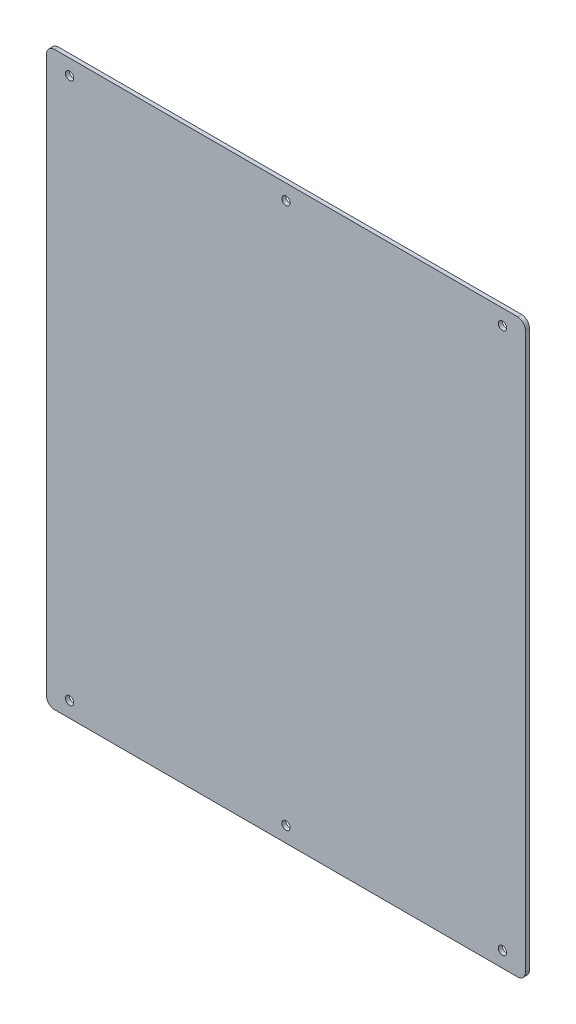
ISO-10303-21;
HEADER;
FILE_DESCRIPTION(('STEP AP214'),'2;1');
FILE_NAME('part.step','',(''),(''),'','','');
FILE_SCHEMA(('AUTOMOTIVE_DESIGN { 1 0 10303 214 1 1 1 1 }'));
ENDSEC;
DATA;
#1=APPLICATION_CONTEXT('core data for automotive mechanical design processes');
#2=APPLICATION_PROTOCOL_DEFINITION('international standard','automotive_design',2000,#1);
#3=PRODUCT_CONTEXT('',#1,'mechanical');
#4=PRODUCT('Part','Part','',(#3));
#5=PRODUCT_RELATED_PRODUCT_CATEGORY('part','',(#4));
#6=PRODUCT_DEFINITION_FORMATION('','',#4);
#7=PRODUCT_DEFINITION_CONTEXT('part definition',#1,'design');
#8=PRODUCT_DEFINITION('design','',#6,#7);
#9=PRODUCT_DEFINITION_SHAPE('','',#8);
#10=(LENGTH_UNIT() NAMED_UNIT(*) SI_UNIT(.MILLI.,.METRE.));
#11=(NAMED_UNIT(*) PLANE_ANGLE_UNIT() SI_UNIT($,.RADIAN.));
#12=(NAMED_UNIT(*) SI_UNIT($,.STERADIAN.) SOLID_ANGLE_UNIT());
#13=UNCERTAINTY_MEASURE_WITH_UNIT(LENGTH_MEASURE(1.E-05),#10,'distance_accuracy_value','');
#14=(GEOMETRIC_REPRESENTATION_CONTEXT(3) GLOBAL_UNCERTAINTY_ASSIGNED_CONTEXT((#13)) GLOBAL_UNIT_ASSIGNED_CONTEXT((#10,
#11,#12)) REPRESENTATION_CONTEXT('',''));
#15=CARTESIAN_POINT('',(0.,0.,0.));
#16=DIRECTION('',(0.,0.,1.));
#17=DIRECTION('',(1.,0.,0.));
#18=AXIS2_PLACEMENT_3D('',#15,#16,#17);
#19=CARTESIAN_POINT('',(0.,0.,0.));
#20=DIRECTION('',(0.,0.,-1.));
#21=DIRECTION('',(-1.,0.,0.));
#22=AXIS2_PLACEMENT_3D('',#19,#20,#21);
#23=PLANE('',#22);
#24=DIRECTION('',(0.,-1.,0.));
#25=VECTOR('',#24,1.);
#26=CARTESIAN_POINT('',(0.,0.,0.));
#27=LINE('',#26,#25);
#28=CARTESIAN_POINT('',(-1.09476674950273E-13,449.76999984,0.));
#29=VERTEX_POINT('',#28);
#30=CARTESIAN_POINT('',(0.,6.35,0.));
#31=VERTEX_POINT('',#30);
#32=EDGE_CURVE('E113',#29,#31,#27,.T.);
#33=ORIENTED_EDGE('',*,*,#32,.T.);
#34=CARTESIAN_POINT('',(6.35,6.35,0.));
#35=DIRECTION('',(0.,0.,-1.));
#36=DIRECTION('',(-1.,0.,0.));
#37=AXIS2_PLACEMENT_3D('',#34,#35,#36);
#38=CIRCLE('',#37,6.35);
#39=CARTESIAN_POINT('',(6.35,0.,0.));
#40=VERTEX_POINT('',#39);
#41=EDGE_CURVE('E147',#31,#40,#38,.F.);
#42=ORIENTED_EDGE('',*,*,#41,.T.);
#43=DIRECTION('',(1.,0.,0.));
#44=VECTOR('',#43,1.);
#45=CARTESIAN_POINT('',(0.,0.,0.));
#46=LINE('',#45,#44);
#47=CARTESIAN_POINT('',(375.65,0.,0.));
#48=VERTEX_POINT('',#47);
#49=EDGE_CURVE('E130',#40,#48,#46,.T.);
#50=ORIENTED_EDGE('',*,*,#49,.T.);
#51=CARTESIAN_POINT('',(375.65,6.35,0.));
#52=DIRECTION('',(0.,0.,-1.));
#53=DIRECTION('',(-1.,0.,0.));
#54=AXIS2_PLACEMENT_3D('',#51,#52,#53);
#55=CIRCLE('',#54,6.35);
#56=CARTESIAN_POINT('',(382.,6.35,0.));
#57=VERTEX_POINT('',#56);
#58=EDGE_CURVE('E145',#48,#57,#55,.F.);
#59=ORIENTED_EDGE('',*,*,#58,.T.);
#60=DIRECTION('',(0.,1.,0.));
#61=VECTOR('',#60,1.);
#62=CARTESIAN_POINT('',(382.,0.,0.));
#63=LINE('',#62,#61);
#64=CARTESIAN_POINT('',(382.,449.76999984,0.));
#65=VERTEX_POINT('',#64);
#66=EDGE_CURVE('E173',#57,#65,#63,.T.);
#67=ORIENTED_EDGE('',*,*,#66,.T.);
#68=CARTESIAN_POINT('',(375.65,449.76999984,0.));
#69=DIRECTION('',(0.,0.,-1.));
#70=DIRECTION('',(-1.,0.,0.));
#71=AXIS2_PLACEMENT_3D('',#68,#69,#70);
#72=CIRCLE('',#71,6.35);
#73=CARTESIAN_POINT('',(375.65,456.11999984,0.));
#74=VERTEX_POINT('',#73);
#75=EDGE_CURVE('E120',#65,#74,#72,.F.);
#76=ORIENTED_EDGE('',*,*,#75,.T.);
#77=DIRECTION('',(-1.,0.,0.));
#78=VECTOR('',#77,1.);
#79=CARTESIAN_POINT('',(-1.11022302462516E-13,456.11999984,0.));
#80=LINE('',#79,#78);
#81=CARTESIAN_POINT('',(6.34999999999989,456.11999984,0.));
#82=VERTEX_POINT('',#81);
#83=EDGE_CURVE('E115',#74,#82,#80,.T.);
#84=ORIENTED_EDGE('',*,*,#83,.T.);
#85=CARTESIAN_POINT('',(6.34999999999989,449.76999984,0.));
#86=DIRECTION('',(0.,0.,-1.));
#87=DIRECTION('',(-1.,0.,0.));
#88=AXIS2_PLACEMENT_3D('',#85,#86,#87);
#89=CIRCLE('',#88,6.35);
#90=EDGE_CURVE('E110',#82,#29,#89,.F.);
#91=ORIENTED_EDGE('',*,*,#90,.T.);
#92=EDGE_LOOP('',(#33,#42,#50,#59,#67,#76,#84,#91));
#93=FACE_BOUND('',#92,.T.);
#94=CARTESIAN_POINT('',(18.3499999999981,12.2999996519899,0.));
#95=DIRECTION('',(0.,0.,1.));
#96=DIRECTION('',(1.,0.,0.));
#97=AXIS2_PLACEMENT_3D('',#94,#95,#96);
#98=CIRCLE('',#97,3.3);
#99=CARTESIAN_POINT('',(21.6499999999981,12.2999996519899,0.));
#100=VERTEX_POINT('',#99);
#101=EDGE_CURVE('E185',#100,#100,#98,.T.);
#102=ORIENTED_EDGE('',*,*,#101,.F.);
#103=EDGE_LOOP('',(#102));
#104=FACE_BOUND('',#103,.T.);
#105=CARTESIAN_POINT('',(190.999999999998,12.2999996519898,0.));
#106=DIRECTION('',(0.,0.,1.));
#107=DIRECTION('',(1.,0.,0.));
#108=AXIS2_PLACEMENT_3D('',#105,#106,#107);
#109=CIRCLE('',#108,3.3);
#110=CARTESIAN_POINT('',(194.299999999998,12.2999996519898,0.));
#111=VERTEX_POINT('',#110);
#112=EDGE_CURVE('E191',#111,#111,#109,.T.);
#113=ORIENTED_EDGE('',*,*,#112,.F.);
#114=EDGE_LOOP('',(#113));
#115=FACE_BOUND('',#114,.T.);
#116=CARTESIAN_POINT('',(363.649999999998,12.2999996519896,0.));
#117=DIRECTION('',(0.,0.,1.));
#118=DIRECTION('',(1.,0.,0.));
#119=AXIS2_PLACEMENT_3D('',#116,#117,#118);
#120=CIRCLE('',#119,3.30000000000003);
#121=CARTESIAN_POINT('',(366.949999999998,12.2999996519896,0.));
#122=VERTEX_POINT('',#121);
#123=EDGE_CURVE('E197',#122,#122,#120,.T.);
#124=ORIENTED_EDGE('',*,*,#123,.F.);
#125=EDGE_LOOP('',(#124));
#126=FACE_BOUND('',#125,.T.);
#127=CARTESIAN_POINT('',(363.649999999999,443.819999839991,0.));
#128=DIRECTION('',(0.,0.,1.));
#129=DIRECTION('',(1.,0.,0.));
#130=AXIS2_PLACEMENT_3D('',#127,#128,#129);
#131=CIRCLE('',#130,3.30000000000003);
#132=CARTESIAN_POINT('',(366.949999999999,443.819999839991,0.));
#133=VERTEX_POINT('',#132);
#134=EDGE_CURVE('E203',#133,#133,#131,.T.);
#135=ORIENTED_EDGE('',*,*,#134,.F.);
#136=EDGE_LOOP('',(#135));
#137=FACE_BOUND('',#136,.T.);
#138=CARTESIAN_POINT('',(190.999999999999,443.819999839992,0.));
#139=DIRECTION('',(0.,0.,1.));
#140=DIRECTION('',(1.,0.,0.));
#141=AXIS2_PLACEMENT_3D('',#138,#139,#140);
#142=CIRCLE('',#141,3.3);
#143=CARTESIAN_POINT('',(194.299999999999,443.819999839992,0.));
#144=VERTEX_POINT('',#143);
#145=EDGE_CURVE('E209',#144,#144,#142,.T.);
#146=ORIENTED_EDGE('',*,*,#145,.F.);
#147=EDGE_LOOP('',(#146));
#148=FACE_BOUND('',#147,.T.);
#149=CARTESIAN_POINT('',(18.3499999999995,443.819999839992,0.));
#150=DIRECTION('',(0.,0.,1.));
#151=DIRECTION('',(1.,0.,0.));
#152=AXIS2_PLACEMENT_3D('',#149,#150,#151);
#153=CIRCLE('',#152,3.3);
#154=CARTESIAN_POINT('',(21.6499999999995,443.819999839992,0.));
#155=VERTEX_POINT('',#154);
#156=EDGE_CURVE('E215',#155,#155,#153,.T.);
#157=ORIENTED_EDGE('',*,*,#156,.F.);
#158=EDGE_LOOP('',(#157));
#159=FACE_BOUND('',#158,.T.);
#160=ADVANCED_FACE('F44',(#93,#104,#115,#126,#137,#148,#159),#23,.F.);
#161=CARTESIAN_POINT('',(0.,0.,-3.175));
#162=DIRECTION('',(-1.,0.,0.));
#163=DIRECTION('',(0.,-1.,0.));
#164=AXIS2_PLACEMENT_3D('',#161,#162,#163);
#165=PLANE('',#164);
#166=DIRECTION('',(0.,-1.,0.));
#167=VECTOR('',#166,1.);
#168=CARTESIAN_POINT('',(0.,0.,-3.175));
#169=LINE('',#168,#167);
#170=CARTESIAN_POINT('',(-1.09476674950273E-13,449.76999984,-3.175));
#171=VERTEX_POINT('',#170);
#172=CARTESIAN_POINT('',(0.,6.35,-3.175));
#173=VERTEX_POINT('',#172);
#174=EDGE_CURVE('E175',#171,#173,#169,.T.);
#175=ORIENTED_EDGE('',*,*,#174,.T.);
#176=DIRECTION('',(0.,0.,1.));
#177=VECTOR('',#176,1.);
#178=CARTESIAN_POINT('',(0.,6.35,-3.175));
#179=LINE('',#178,#177);
#180=EDGE_CURVE('E121',#173,#31,#179,.T.);
#181=ORIENTED_EDGE('',*,*,#180,.T.);
#182=ORIENTED_EDGE('',*,*,#32,.F.);
#183=DIRECTION('',(0.,0.,1.));
#184=VECTOR('',#183,1.);
#185=CARTESIAN_POINT('',(-1.09476674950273E-13,449.76999984,-3.175));
#186=LINE('',#185,#184);
#187=EDGE_CURVE('E127',#29,#171,#186,.F.);
#188=ORIENTED_EDGE('',*,*,#187,.T.);
#189=EDGE_LOOP('',(#175,#181,#182,#188));
#190=FACE_BOUND('',#189,.T.);
#191=ADVANCED_FACE('F126',(#190),#165,.T.);
#192=CARTESIAN_POINT('',(-1.11022302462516E-13,456.11999984,-3.175));
#193=DIRECTION('',(0.,1.,0.));
#194=DIRECTION('',(0.,0.,1.));
#195=AXIS2_PLACEMENT_3D('',#192,#193,#194);
#196=PLANE('',#195);
#197=ORIENTED_EDGE('',*,*,#83,.F.);
#198=DIRECTION('',(0.,0.,1.));
#199=VECTOR('',#198,1.);
#200=CARTESIAN_POINT('',(375.65,456.11999984,-3.175));
#201=LINE('',#200,#199);
#202=CARTESIAN_POINT('',(375.65,456.11999984,-3.175));
#203=VERTEX_POINT('',#202);
#204=EDGE_CURVE('E11',#74,#203,#201,.F.);
#205=ORIENTED_EDGE('',*,*,#204,.T.);
#206=DIRECTION('',(-1.,0.,0.));
#207=VECTOR('',#206,1.);
#208=CARTESIAN_POINT('',(-1.11022302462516E-13,456.11999984,-3.175));
#209=LINE('',#208,#207);
#210=CARTESIAN_POINT('',(6.34999999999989,456.11999984,-3.175));
#211=VERTEX_POINT('',#210);
#212=EDGE_CURVE('E135',#203,#211,#209,.T.);
#213=ORIENTED_EDGE('',*,*,#212,.T.);
#214=DIRECTION('',(0.,0.,1.));
#215=VECTOR('',#214,1.);
#216=CARTESIAN_POINT('',(6.34999999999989,456.11999984,-3.175));
#217=LINE('',#216,#215);
#218=EDGE_CURVE('E52',#211,#82,#217,.T.);
#219=ORIENTED_EDGE('',*,*,#218,.T.);
#220=EDGE_LOOP('',(#197,#205,#213,#219));
#221=FACE_BOUND('',#220,.T.);
#222=ADVANCED_FACE('F164',(#221),#196,.T.);
#223=CARTESIAN_POINT('',(382.,0.,-3.175));
#224=DIRECTION('',(1.,0.,0.));
#225=DIRECTION('',(0.,1.,0.));
#226=AXIS2_PLACEMENT_3D('',#223,#224,#225);
#227=PLANE('',#226);
#228=ORIENTED_EDGE('',*,*,#66,.F.);
#229=DIRECTION('',(0.,0.,1.));
#230=VECTOR('',#229,1.);
#231=CARTESIAN_POINT('',(382.,6.35,-3.175));
#232=LINE('',#231,#230);
#233=CARTESIAN_POINT('',(382.,6.35,-3.175));
#234=VERTEX_POINT('',#233);
#235=EDGE_CURVE('E66',#57,#234,#232,.F.);
#236=ORIENTED_EDGE('',*,*,#235,.T.);
#237=DIRECTION('',(0.,1.,0.));
#238=VECTOR('',#237,1.);
#239=CARTESIAN_POINT('',(382.,0.,-3.175));
#240=LINE('',#239,#238);
#241=CARTESIAN_POINT('',(382.,449.76999984,-3.175));
#242=VERTEX_POINT('',#241);
#243=EDGE_CURVE('E139',#234,#242,#240,.T.);
#244=ORIENTED_EDGE('',*,*,#243,.T.);
#245=DIRECTION('',(0.,0.,1.));
#246=VECTOR('',#245,1.);
#247=CARTESIAN_POINT('',(382.,449.76999984,-3.175));
#248=LINE('',#247,#246);
#249=EDGE_CURVE('E160',#242,#65,#248,.T.);
#250=ORIENTED_EDGE('',*,*,#249,.T.);
#251=EDGE_LOOP('',(#228,#236,#244,#250));
#252=FACE_BOUND('',#251,.T.);
#253=ADVANCED_FACE('F172',(#252),#227,.T.);
#254=CARTESIAN_POINT('',(0.,0.,-3.175));
#255=DIRECTION('',(0.,-1.,0.));
#256=DIRECTION('',(0.,0.,-1.));
#257=AXIS2_PLACEMENT_3D('',#254,#255,#256);
#258=PLANE('',#257);
#259=ORIENTED_EDGE('',*,*,#49,.F.);
#260=DIRECTION('',(0.,0.,1.));
#261=VECTOR('',#260,1.);
#262=CARTESIAN_POINT('',(6.35,0.,-3.175));
#263=LINE('',#262,#261);
#264=CARTESIAN_POINT('',(6.35,0.,-3.175));
#265=VERTEX_POINT('',#264);
#266=EDGE_CURVE('E152',#40,#265,#263,.F.);
#267=ORIENTED_EDGE('',*,*,#266,.T.);
#268=DIRECTION('',(1.,0.,0.));
#269=VECTOR('',#268,1.);
#270=CARTESIAN_POINT('',(0.,0.,-3.175));
#271=LINE('',#270,#269);
#272=CARTESIAN_POINT('',(375.65,0.,-3.175));
#273=VERTEX_POINT('',#272);
#274=EDGE_CURVE('E179',#265,#273,#271,.T.);
#275=ORIENTED_EDGE('',*,*,#274,.T.);
#276=DIRECTION('',(0.,0.,1.));
#277=VECTOR('',#276,1.);
#278=CARTESIAN_POINT('',(375.65,0.,-3.175));
#279=LINE('',#278,#277);
#280=EDGE_CURVE('E149',#273,#48,#279,.T.);
#281=ORIENTED_EDGE('',*,*,#280,.T.);
#282=EDGE_LOOP('',(#259,#267,#275,#281));
#283=FACE_BOUND('',#282,.T.);
#284=ADVANCED_FACE('F237',(#283),#258,.T.);
#285=CARTESIAN_POINT('',(0.,0.,-3.175));
#286=DIRECTION('',(0.,0.,-1.));
#287=DIRECTION('',(-1.,0.,0.));
#288=AXIS2_PLACEMENT_3D('',#285,#286,#287);
#289=PLANE('',#288);
#290=CARTESIAN_POINT('',(18.3499999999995,443.819999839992,-3.175));
#291=DIRECTION('',(0.,0.,-1.));
#292=DIRECTION('',(-1.,0.,0.));
#293=AXIS2_PLACEMENT_3D('',#290,#291,#292);
#294=CIRCLE('',#293,3.3);
#295=CARTESIAN_POINT('',(15.0499999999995,443.819999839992,-3.175));
#296=VERTEX_POINT('',#295);
#297=EDGE_CURVE('E212',#296,#296,#294,.T.);
#298=ORIENTED_EDGE('',*,*,#297,.F.);
#299=EDGE_LOOP('',(#298));
#300=FACE_BOUND('',#299,.T.);
#301=CARTESIAN_POINT('',(190.999999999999,443.819999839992,-3.175));
#302=DIRECTION('',(0.,0.,-1.));
#303=DIRECTION('',(-1.,0.,0.));
#304=AXIS2_PLACEMENT_3D('',#301,#302,#303);
#305=CIRCLE('',#304,3.3);
#306=CARTESIAN_POINT('',(187.699999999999,443.819999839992,-3.175));
#307=VERTEX_POINT('',#306);
#308=EDGE_CURVE('E206',#307,#307,#305,.T.);
#309=ORIENTED_EDGE('',*,*,#308,.F.);
#310=EDGE_LOOP('',(#309));
#311=FACE_BOUND('',#310,.T.);
#312=CARTESIAN_POINT('',(363.649999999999,443.819999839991,-3.175));
#313=DIRECTION('',(0.,0.,-1.));
#314=DIRECTION('',(-1.,0.,0.));
#315=AXIS2_PLACEMENT_3D('',#312,#313,#314);
#316=CIRCLE('',#315,3.30000000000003);
#317=CARTESIAN_POINT('',(360.349999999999,443.819999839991,-3.175));
#318=VERTEX_POINT('',#317);
#319=EDGE_CURVE('E200',#318,#318,#316,.T.);
#320=ORIENTED_EDGE('',*,*,#319,.F.);
#321=EDGE_LOOP('',(#320));
#322=FACE_BOUND('',#321,.T.);
#323=CARTESIAN_POINT('',(363.649999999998,12.2999996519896,-3.175));
#324=DIRECTION('',(0.,0.,-1.));
#325=DIRECTION('',(-1.,0.,0.));
#326=AXIS2_PLACEMENT_3D('',#323,#324,#325);
#327=CIRCLE('',#326,3.30000000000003);
#328=CARTESIAN_POINT('',(360.349999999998,12.2999996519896,-3.175));
#329=VERTEX_POINT('',#328);
#330=EDGE_CURVE('E194',#329,#329,#327,.T.);
#331=ORIENTED_EDGE('',*,*,#330,.F.);
#332=EDGE_LOOP('',(#331));
#333=FACE_BOUND('',#332,.T.);
#334=CARTESIAN_POINT('',(190.999999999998,12.2999996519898,-3.175));
#335=DIRECTION('',(0.,0.,-1.));
#336=DIRECTION('',(-1.,0.,0.));
#337=AXIS2_PLACEMENT_3D('',#334,#335,#336);
#338=CIRCLE('',#337,3.3);
#339=CARTESIAN_POINT('',(187.699999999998,12.2999996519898,-3.175));
#340=VERTEX_POINT('',#339);
#341=EDGE_CURVE('E188',#340,#340,#338,.T.);
#342=ORIENTED_EDGE('',*,*,#341,.F.);
#343=EDGE_LOOP('',(#342));
#344=FACE_BOUND('',#343,.T.);
#345=CARTESIAN_POINT('',(18.3499999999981,12.2999996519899,-3.175));
#346=DIRECTION('',(0.,0.,-1.));
#347=DIRECTION('',(-1.,0.,0.));
#348=AXIS2_PLACEMENT_3D('',#345,#346,#347);
#349=CIRCLE('',#348,3.3);
#350=CARTESIAN_POINT('',(15.0499999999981,12.2999996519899,-3.175));
#351=VERTEX_POINT('',#350);
#352=EDGE_CURVE('E131',#351,#351,#349,.T.);
#353=ORIENTED_EDGE('',*,*,#352,.F.);
#354=EDGE_LOOP('',(#353));
#355=FACE_BOUND('',#354,.T.);
#356=ORIENTED_EDGE('',*,*,#274,.F.);
#357=CARTESIAN_POINT('',(6.35,6.35,-3.175));
#358=DIRECTION('',(0.,0.,-1.));
#359=DIRECTION('',(-1.,0.,0.));
#360=AXIS2_PLACEMENT_3D('',#357,#358,#359);
#361=CIRCLE('',#360,6.35);
#362=EDGE_CURVE('E158',#265,#173,#361,.T.);
#363=ORIENTED_EDGE('',*,*,#362,.T.);
#364=ORIENTED_EDGE('',*,*,#174,.F.);
#365=CARTESIAN_POINT('',(6.34999999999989,449.76999984,-3.175));
#366=DIRECTION('',(0.,0.,-1.));
#367=DIRECTION('',(-1.,0.,0.));
#368=AXIS2_PLACEMENT_3D('',#365,#366,#367);
#369=CIRCLE('',#368,6.35);
#370=EDGE_CURVE('E134',#171,#211,#369,.T.);
#371=ORIENTED_EDGE('',*,*,#370,.T.);
#372=ORIENTED_EDGE('',*,*,#212,.F.);
#373=CARTESIAN_POINT('',(375.65,449.76999984,-3.175));
#374=DIRECTION('',(0.,0.,-1.));
#375=DIRECTION('',(-1.,0.,0.));
#376=AXIS2_PLACEMENT_3D('',#373,#374,#375);
#377=CIRCLE('',#376,6.35);
#378=EDGE_CURVE('E59',#203,#242,#377,.T.);
#379=ORIENTED_EDGE('',*,*,#378,.T.);
#380=ORIENTED_EDGE('',*,*,#243,.F.);
#381=CARTESIAN_POINT('',(375.65,6.35,-3.175));
#382=DIRECTION('',(0.,0.,-1.));
#383=DIRECTION('',(-1.,0.,0.));
#384=AXIS2_PLACEMENT_3D('',#381,#382,#383);
#385=CIRCLE('',#384,6.35);
#386=EDGE_CURVE('E156',#234,#273,#385,.T.);
#387=ORIENTED_EDGE('',*,*,#386,.T.);
#388=EDGE_LOOP('',(#356,#363,#364,#371,#372,#379,#380,#387));
#389=FACE_BOUND('',#388,.T.);
#390=ADVANCED_FACE('F167',(#300,#311,#322,#333,#344,#355,#389),#289,.T.);
#391=CARTESIAN_POINT('',(6.35,6.35,-3.175));
#392=DIRECTION('',(0.,0.,1.));
#393=DIRECTION('',(1.,0.,0.));
#394=AXIS2_PLACEMENT_3D('',#391,#392,#393);
#395=CYLINDRICAL_SURFACE('',#394,6.35);
#396=ORIENTED_EDGE('',*,*,#362,.F.);
#397=ORIENTED_EDGE('',*,*,#266,.F.);
#398=ORIENTED_EDGE('',*,*,#41,.F.);
#399=ORIENTED_EDGE('',*,*,#180,.F.);
#400=EDGE_LOOP('',(#396,#397,#398,#399));
#401=FACE_BOUND('',#400,.T.);
#402=ADVANCED_FACE('F241',(#401),#395,.T.);
#403=CARTESIAN_POINT('',(375.65,6.35,-3.175));
#404=DIRECTION('',(0.,0.,1.));
#405=DIRECTION('',(1.,0.,0.));
#406=AXIS2_PLACEMENT_3D('',#403,#404,#405);
#407=CYLINDRICAL_SURFACE('',#406,6.35);
#408=ORIENTED_EDGE('',*,*,#386,.F.);
#409=ORIENTED_EDGE('',*,*,#235,.F.);
#410=ORIENTED_EDGE('',*,*,#58,.F.);
#411=ORIENTED_EDGE('',*,*,#280,.F.);
#412=EDGE_LOOP('',(#408,#409,#410,#411));
#413=FACE_BOUND('',#412,.T.);
#414=ADVANCED_FACE('F244',(#413),#407,.T.);
#415=CARTESIAN_POINT('',(375.65,449.76999984,-3.175));
#416=DIRECTION('',(0.,0.,1.));
#417=DIRECTION('',(1.,0.,0.));
#418=AXIS2_PLACEMENT_3D('',#415,#416,#417);
#419=CYLINDRICAL_SURFACE('',#418,6.35);
#420=ORIENTED_EDGE('',*,*,#378,.F.);
#421=ORIENTED_EDGE('',*,*,#204,.F.);
#422=ORIENTED_EDGE('',*,*,#75,.F.);
#423=ORIENTED_EDGE('',*,*,#249,.F.);
#424=EDGE_LOOP('',(#420,#421,#422,#423));
#425=FACE_BOUND('',#424,.T.);
#426=ADVANCED_FACE('F170',(#425),#419,.T.);
#427=CARTESIAN_POINT('',(6.34999999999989,449.76999984,-3.175));
#428=DIRECTION('',(0.,0.,1.));
#429=DIRECTION('',(1.,0.,0.));
#430=AXIS2_PLACEMENT_3D('',#427,#428,#429);
#431=CYLINDRICAL_SURFACE('',#430,6.35);
#432=ORIENTED_EDGE('',*,*,#370,.F.);
#433=ORIENTED_EDGE('',*,*,#187,.F.);
#434=ORIENTED_EDGE('',*,*,#90,.F.);
#435=ORIENTED_EDGE('',*,*,#218,.F.);
#436=EDGE_LOOP('',(#432,#433,#434,#435));
#437=FACE_BOUND('',#436,.T.);
#438=ADVANCED_FACE('F46',(#437),#431,.T.);
#439=CARTESIAN_POINT('',(18.3499999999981,12.2999996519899,0.));
#440=DIRECTION('',(0.,0.,1.));
#441=DIRECTION('',(1.,0.,0.));
#442=AXIS2_PLACEMENT_3D('',#439,#440,#441);
#443=CYLINDRICAL_SURFACE('',#442,3.3);
#444=ORIENTED_EDGE('',*,*,#101,.T.);
#445=EDGE_LOOP('',(#444));
#446=FACE_BOUND('',#445,.T.);
#447=ORIENTED_EDGE('',*,*,#352,.T.);
#448=EDGE_LOOP('',(#447));
#449=FACE_BOUND('',#448,.T.);
#450=ADVANCED_FACE('F251',(#446,#449),#443,.F.);
#451=CARTESIAN_POINT('',(190.999999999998,12.2999996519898,0.));
#452=DIRECTION('',(0.,0.,1.));
#453=DIRECTION('',(1.,0.,0.));
#454=AXIS2_PLACEMENT_3D('',#451,#452,#453);
#455=CYLINDRICAL_SURFACE('',#454,3.3);
#456=ORIENTED_EDGE('',*,*,#112,.T.);
#457=EDGE_LOOP('',(#456));
#458=FACE_BOUND('',#457,.T.);
#459=ORIENTED_EDGE('',*,*,#341,.T.);
#460=EDGE_LOOP('',(#459));
#461=FACE_BOUND('',#460,.T.);
#462=ADVANCED_FACE('F255',(#458,#461),#455,.F.);
#463=CARTESIAN_POINT('',(363.649999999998,12.2999996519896,0.));
#464=DIRECTION('',(0.,0.,1.));
#465=DIRECTION('',(1.,0.,0.));
#466=AXIS2_PLACEMENT_3D('',#463,#464,#465);
#467=CYLINDRICAL_SURFACE('',#466,3.30000000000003);
#468=ORIENTED_EDGE('',*,*,#123,.T.);
#469=EDGE_LOOP('',(#468));
#470=FACE_BOUND('',#469,.T.);
#471=ORIENTED_EDGE('',*,*,#330,.T.);
#472=EDGE_LOOP('',(#471));
#473=FACE_BOUND('',#472,.T.);
#474=ADVANCED_FACE('F260',(#470,#473),#467,.F.);
#475=CARTESIAN_POINT('',(363.649999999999,443.819999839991,0.));
#476=DIRECTION('',(0.,0.,1.));
#477=DIRECTION('',(1.,0.,0.));
#478=AXIS2_PLACEMENT_3D('',#475,#476,#477);
#479=CYLINDRICAL_SURFACE('',#478,3.30000000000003);
#480=ORIENTED_EDGE('',*,*,#134,.T.);
#481=EDGE_LOOP('',(#480));
#482=FACE_BOUND('',#481,.T.);
#483=ORIENTED_EDGE('',*,*,#319,.T.);
#484=EDGE_LOOP('',(#483));
#485=FACE_BOUND('',#484,.T.);
#486=ADVANCED_FACE('F267',(#482,#485),#479,.F.);
#487=CARTESIAN_POINT('',(190.999999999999,443.819999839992,0.));
#488=DIRECTION('',(0.,0.,1.));
#489=DIRECTION('',(1.,0.,0.));
#490=AXIS2_PLACEMENT_3D('',#487,#488,#489);
#491=CYLINDRICAL_SURFACE('',#490,3.3);
#492=ORIENTED_EDGE('',*,*,#145,.T.);
#493=EDGE_LOOP('',(#492));
#494=FACE_BOUND('',#493,.T.);
#495=ORIENTED_EDGE('',*,*,#308,.T.);
#496=EDGE_LOOP('',(#495));
#497=FACE_BOUND('',#496,.T.);
#498=ADVANCED_FACE('F271',(#494,#497),#491,.F.);
#499=CARTESIAN_POINT('',(18.3499999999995,443.819999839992,0.));
#500=DIRECTION('',(0.,0.,1.));
#501=DIRECTION('',(1.,0.,0.));
#502=AXIS2_PLACEMENT_3D('',#499,#500,#501);
#503=CYLINDRICAL_SURFACE('',#502,3.3);
#504=ORIENTED_EDGE('',*,*,#156,.T.);
#505=EDGE_LOOP('',(#504));
#506=FACE_BOUND('',#505,.T.);
#507=ORIENTED_EDGE('',*,*,#297,.T.);
#508=EDGE_LOOP('',(#507));
#509=FACE_BOUND('',#508,.T.);
#510=ADVANCED_FACE('F219',(#506,#509),#503,.F.);
#511=CLOSED_SHELL('',(#160,#191,#222,#253,#284,#390,#402,#414,#426,#438,#450,#462,#474,#486,
#498,#510));
#512=MANIFOLD_SOLID_BREP('B2',#511);
#513=ADVANCED_BREP_SHAPE_REPRESENTATION('',(#18,#512),#14);
#514=SHAPE_DEFINITION_REPRESENTATION(#9,#513);
ENDSEC;
END-ISO-10303-21;
